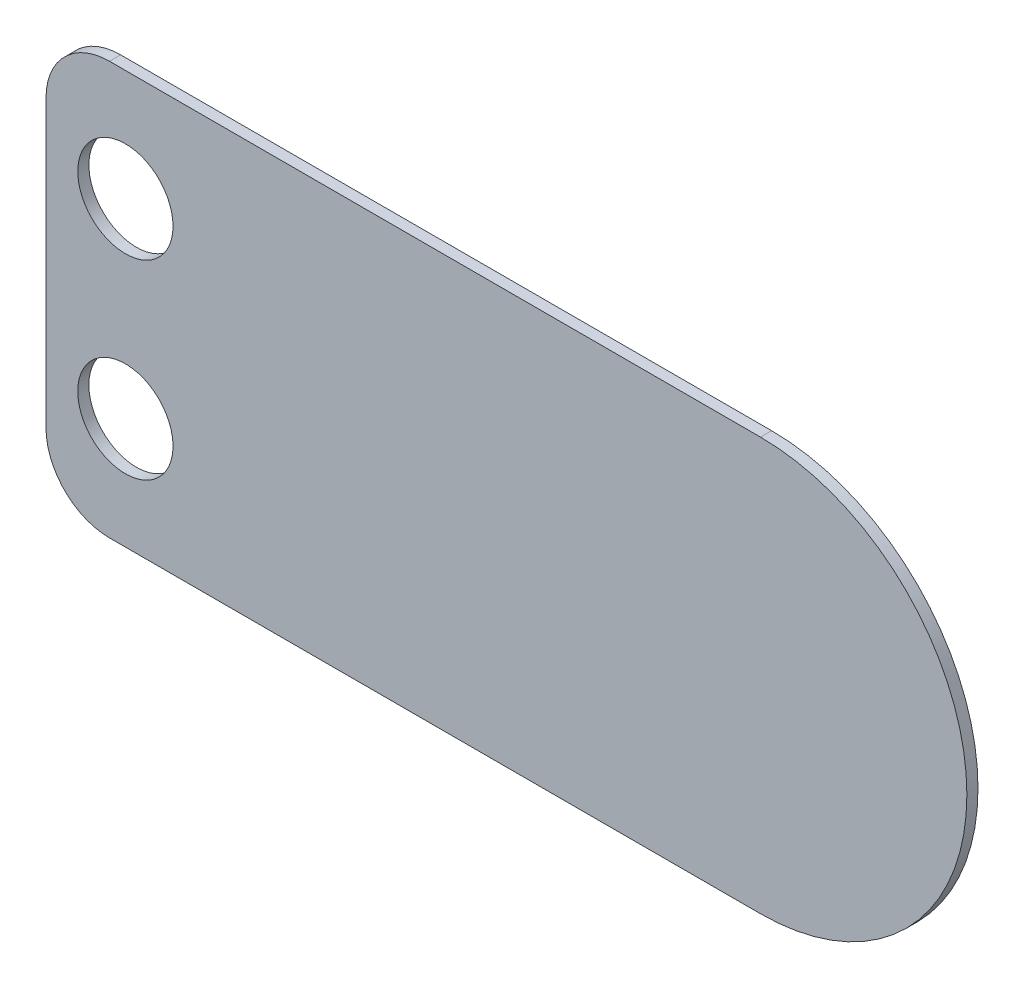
ISO-10303-21;
HEADER;
FILE_DESCRIPTION(('STEP AP214'),'2;1');
FILE_NAME('part.step','',(''),(''),'','','');
FILE_SCHEMA(('AUTOMOTIVE_DESIGN { 1 0 10303 214 1 1 1 1 }'));
ENDSEC;
DATA;
#1=APPLICATION_CONTEXT('core data for automotive mechanical design processes');
#2=APPLICATION_PROTOCOL_DEFINITION('international standard','automotive_design',2000,#1);
#3=PRODUCT_CONTEXT('',#1,'mechanical');
#4=PRODUCT('Part','Part','',(#3));
#5=PRODUCT_RELATED_PRODUCT_CATEGORY('part','',(#4));
#6=PRODUCT_DEFINITION_FORMATION('','',#4);
#7=PRODUCT_DEFINITION_CONTEXT('part definition',#1,'design');
#8=PRODUCT_DEFINITION('design','',#6,#7);
#9=PRODUCT_DEFINITION_SHAPE('','',#8);
#10=(LENGTH_UNIT() NAMED_UNIT(*) SI_UNIT(.MILLI.,.METRE.));
#11=(NAMED_UNIT(*) PLANE_ANGLE_UNIT() SI_UNIT($,.RADIAN.));
#12=(NAMED_UNIT(*) SI_UNIT($,.STERADIAN.) SOLID_ANGLE_UNIT());
#13=UNCERTAINTY_MEASURE_WITH_UNIT(LENGTH_MEASURE(1.E-05),#10,'distance_accuracy_value','');
#14=(GEOMETRIC_REPRESENTATION_CONTEXT(3) GLOBAL_UNCERTAINTY_ASSIGNED_CONTEXT((#13)) GLOBAL_UNIT_ASSIGNED_CONTEXT((#10,
#11,#12)) REPRESENTATION_CONTEXT('',''));
#15=CARTESIAN_POINT('',(0.,0.,0.));
#16=DIRECTION('',(0.,0.,1.));
#17=DIRECTION('',(1.,0.,0.));
#18=AXIS2_PLACEMENT_3D('',#15,#16,#17);
#19=CARTESIAN_POINT('',(0.,0.,0.35));
#20=DIRECTION('',(0.,0.,1.));
#21=DIRECTION('',(1.,0.,0.));
#22=AXIS2_PLACEMENT_3D('',#19,#20,#21);
#23=PLANE('',#22);
#24=CARTESIAN_POINT('',(-20.,3.,0.35));
#25=DIRECTION('',(0.,0.,1.));
#26=DIRECTION('',(1.,0.,0.));
#27=AXIS2_PLACEMENT_3D('',#24,#25,#26);
#28=CIRCLE('',#27,1.5);
#29=CARTESIAN_POINT('',(-18.5,3.,0.35));
#30=VERTEX_POINT('',#29);
#31=EDGE_CURVE('E105',#30,#30,#28,.T.);
#32=ORIENTED_EDGE('',*,*,#31,.F.);
#33=EDGE_LOOP('',(#32));
#34=FACE_BOUND('',#33,.T.);
#35=DIRECTION('',(0.,-1.,0.));
#36=VECTOR('',#35,1.);
#37=CARTESIAN_POINT('',(-22.5,6.5,0.35));
#38=LINE('',#37,#36);
#39=CARTESIAN_POINT('',(-22.5,4.5,0.35));
#40=VERTEX_POINT('',#39);
#41=CARTESIAN_POINT('',(-22.5,-4.5,0.35));
#42=VERTEX_POINT('',#41);
#43=EDGE_CURVE('E118',#40,#42,#38,.T.);
#44=ORIENTED_EDGE('',*,*,#43,.T.);
#45=CARTESIAN_POINT('',(-20.5,-4.5,0.35));
#46=DIRECTION('',(0.,0.,1.));
#47=DIRECTION('',(1.,0.,0.));
#48=AXIS2_PLACEMENT_3D('',#45,#46,#47);
#49=CIRCLE('',#48,2.);
#50=CARTESIAN_POINT('',(-20.5,-6.5,0.35));
#51=VERTEX_POINT('',#50);
#52=EDGE_CURVE('E37',#42,#51,#49,.T.);
#53=ORIENTED_EDGE('',*,*,#52,.T.);
#54=DIRECTION('',(1.,0.,0.));
#55=VECTOR('',#54,1.);
#56=CARTESIAN_POINT('',(0.,-6.5,0.35));
#57=LINE('',#56,#55);
#58=CARTESIAN_POINT('',(0.,-6.5,0.35));
#59=VERTEX_POINT('',#58);
#60=EDGE_CURVE('E120',#51,#59,#57,.T.);
#61=ORIENTED_EDGE('',*,*,#60,.T.);
#62=CARTESIAN_POINT('',(0.,0.,0.35));
#63=DIRECTION('',(0.,0.,1.));
#64=DIRECTION('',(1.,0.,0.));
#65=AXIS2_PLACEMENT_3D('',#62,#63,#64);
#66=CIRCLE('',#65,6.5);
#67=CARTESIAN_POINT('',(0.,6.5,0.35));
#68=VERTEX_POINT('',#67);
#69=EDGE_CURVE('E115',#59,#68,#66,.T.);
#70=ORIENTED_EDGE('',*,*,#69,.T.);
#71=DIRECTION('',(-1.,0.,0.));
#72=VECTOR('',#71,1.);
#73=CARTESIAN_POINT('',(0.,6.5,0.35));
#74=LINE('',#73,#72);
#75=CARTESIAN_POINT('',(-20.5,6.5,0.35));
#76=VERTEX_POINT('',#75);
#77=EDGE_CURVE('E96',#68,#76,#74,.T.);
#78=ORIENTED_EDGE('',*,*,#77,.T.);
#79=CARTESIAN_POINT('',(-20.5,4.5,0.35));
#80=DIRECTION('',(0.,0.,1.));
#81=DIRECTION('',(1.,0.,0.));
#82=AXIS2_PLACEMENT_3D('',#79,#80,#81);
#83=CIRCLE('',#82,2.);
#84=EDGE_CURVE('E132',#76,#40,#83,.T.);
#85=ORIENTED_EDGE('',*,*,#84,.T.);
#86=EDGE_LOOP('',(#44,#53,#61,#70,#78,#85));
#87=FACE_BOUND('',#86,.T.);
#88=CARTESIAN_POINT('',(-20.,-3.,0.35));
#89=DIRECTION('',(0.,0.,1.));
#90=DIRECTION('',(-1.,0.,0.));
#91=AXIS2_PLACEMENT_3D('',#88,#89,#90);
#92=CIRCLE('',#91,1.5);
#93=CARTESIAN_POINT('',(-21.5,-3.,0.35));
#94=VERTEX_POINT('',#93);
#95=EDGE_CURVE('E231',#94,#94,#92,.T.);
#96=ORIENTED_EDGE('',*,*,#95,.F.);
#97=EDGE_LOOP('',(#96));
#98=FACE_BOUND('',#97,.T.);
#99=ADVANCED_FACE('F29',(#34,#87,#98),#23,.T.);
#100=CARTESIAN_POINT('',(0.,0.,0.));
#101=DIRECTION('',(0.,0.,1.));
#102=DIRECTION('',(1.,0.,0.));
#103=AXIS2_PLACEMENT_3D('',#100,#101,#102);
#104=PLANE('',#103);
#105=CARTESIAN_POINT('',(-20.,3.,0.));
#106=DIRECTION('',(0.,0.,1.));
#107=DIRECTION('',(1.,0.,0.));
#108=AXIS2_PLACEMENT_3D('',#105,#106,#107);
#109=CIRCLE('',#108,1.5);
#110=CARTESIAN_POINT('',(-18.5,3.,0.));
#111=VERTEX_POINT('',#110);
#112=EDGE_CURVE('E108',#111,#111,#109,.T.);
#113=ORIENTED_EDGE('',*,*,#112,.T.);
#114=EDGE_LOOP('',(#113));
#115=FACE_BOUND('',#114,.T.);
#116=DIRECTION('',(1.,0.,0.));
#117=VECTOR('',#116,1.);
#118=CARTESIAN_POINT('',(0.,-6.5,0.));
#119=LINE('',#118,#117);
#120=CARTESIAN_POINT('',(-20.5,-6.5,0.));
#121=VERTEX_POINT('',#120);
#122=CARTESIAN_POINT('',(0.,-6.5,0.));
#123=VERTEX_POINT('',#122);
#124=EDGE_CURVE('E113',#121,#123,#119,.T.);
#125=ORIENTED_EDGE('',*,*,#124,.F.);
#126=CARTESIAN_POINT('',(-20.5,-4.5,0.));
#127=DIRECTION('',(0.,0.,1.));
#128=DIRECTION('',(1.,0.,0.));
#129=AXIS2_PLACEMENT_3D('',#126,#127,#128);
#130=CIRCLE('',#129,2.);
#131=CARTESIAN_POINT('',(-22.5,-4.5,0.));
#132=VERTEX_POINT('',#131);
#133=EDGE_CURVE('E126',#121,#132,#130,.F.);
#134=ORIENTED_EDGE('',*,*,#133,.T.);
#135=DIRECTION('',(0.,-1.,0.));
#136=VECTOR('',#135,1.);
#137=CARTESIAN_POINT('',(-22.5,6.5,0.));
#138=LINE('',#137,#136);
#139=CARTESIAN_POINT('',(-22.5,4.5,0.));
#140=VERTEX_POINT('',#139);
#141=EDGE_CURVE('E91',#140,#132,#138,.T.);
#142=ORIENTED_EDGE('',*,*,#141,.F.);
#143=CARTESIAN_POINT('',(-20.5,4.5,0.));
#144=DIRECTION('',(0.,0.,1.));
#145=DIRECTION('',(1.,0.,0.));
#146=AXIS2_PLACEMENT_3D('',#143,#144,#145);
#147=CIRCLE('',#146,2.);
#148=CARTESIAN_POINT('',(-20.5,6.5,0.));
#149=VERTEX_POINT('',#148);
#150=EDGE_CURVE('E90',#140,#149,#147,.F.);
#151=ORIENTED_EDGE('',*,*,#150,.T.);
#152=DIRECTION('',(-1.,0.,0.));
#153=VECTOR('',#152,1.);
#154=CARTESIAN_POINT('',(0.,6.5,0.));
#155=LINE('',#154,#153);
#156=CARTESIAN_POINT('',(0.,6.5,0.));
#157=VERTEX_POINT('',#156);
#158=EDGE_CURVE('E82',#157,#149,#155,.T.);
#159=ORIENTED_EDGE('',*,*,#158,.F.);
#160=CARTESIAN_POINT('',(0.,0.,0.));
#161=DIRECTION('',(0.,0.,1.));
#162=DIRECTION('',(1.,0.,0.));
#163=AXIS2_PLACEMENT_3D('',#160,#161,#162);
#164=CIRCLE('',#163,6.5);
#165=EDGE_CURVE('E88',#123,#157,#164,.T.);
#166=ORIENTED_EDGE('',*,*,#165,.F.);
#167=EDGE_LOOP('',(#125,#134,#142,#151,#159,#166));
#168=FACE_BOUND('',#167,.T.);
#169=CARTESIAN_POINT('',(-20.,-3.,0.));
#170=DIRECTION('',(0.,0.,1.));
#171=DIRECTION('',(-1.,0.,0.));
#172=AXIS2_PLACEMENT_3D('',#169,#170,#171);
#173=CIRCLE('',#172,1.5);
#174=CARTESIAN_POINT('',(-21.5,-3.,0.));
#175=VERTEX_POINT('',#174);
#176=EDGE_CURVE('E233',#175,#175,#173,.T.);
#177=ORIENTED_EDGE('',*,*,#176,.T.);
#178=EDGE_LOOP('',(#177));
#179=FACE_BOUND('',#178,.T.);
#180=ADVANCED_FACE('F85',(#115,#168,#179),#104,.F.);
#181=CARTESIAN_POINT('',(0.,0.,0.35));
#182=DIRECTION('',(0.,0.,-1.));
#183=DIRECTION('',(-1.,0.,0.));
#184=AXIS2_PLACEMENT_3D('',#181,#182,#183);
#185=CYLINDRICAL_SURFACE('',#184,6.5);
#186=ORIENTED_EDGE('',*,*,#165,.T.);
#187=DIRECTION('',(0.,0.,-1.));
#188=VECTOR('',#187,1.);
#189=CARTESIAN_POINT('',(0.,6.5,0.35));
#190=LINE('',#189,#188);
#191=EDGE_CURVE('E94',#68,#157,#190,.T.);
#192=ORIENTED_EDGE('',*,*,#191,.F.);
#193=ORIENTED_EDGE('',*,*,#69,.F.);
#194=DIRECTION('',(0.,0.,-1.));
#195=VECTOR('',#194,1.);
#196=CARTESIAN_POINT('',(0.,-6.5,0.35));
#197=LINE('',#196,#195);
#198=EDGE_CURVE('E101',#59,#123,#197,.T.);
#199=ORIENTED_EDGE('',*,*,#198,.T.);
#200=EDGE_LOOP('',(#186,#192,#193,#199));
#201=FACE_BOUND('',#200,.T.);
#202=ADVANCED_FACE('F31',(#201),#185,.T.);
#203=CARTESIAN_POINT('',(0.,6.5,0.35));
#204=DIRECTION('',(0.,-1.,0.));
#205=DIRECTION('',(1.,0.,0.));
#206=AXIS2_PLACEMENT_3D('',#203,#204,#205);
#207=PLANE('',#206);
#208=ORIENTED_EDGE('',*,*,#158,.T.);
#209=DIRECTION('',(0.,0.,-1.));
#210=VECTOR('',#209,1.);
#211=CARTESIAN_POINT('',(-20.5,6.5,0.35));
#212=LINE('',#211,#210);
#213=EDGE_CURVE('E11',#149,#76,#212,.F.);
#214=ORIENTED_EDGE('',*,*,#213,.T.);
#215=ORIENTED_EDGE('',*,*,#77,.F.);
#216=ORIENTED_EDGE('',*,*,#191,.T.);
#217=EDGE_LOOP('',(#208,#214,#215,#216));
#218=FACE_BOUND('',#217,.T.);
#219=ADVANCED_FACE('F95',(#218),#207,.F.);
#220=CARTESIAN_POINT('',(-22.5,6.5,0.35));
#221=DIRECTION('',(1.,0.,0.));
#222=DIRECTION('',(0.,0.,-1.));
#223=AXIS2_PLACEMENT_3D('',#220,#221,#222);
#224=PLANE('',#223);
#225=ORIENTED_EDGE('',*,*,#141,.T.);
#226=DIRECTION('',(0.,0.,-1.));
#227=VECTOR('',#226,1.);
#228=CARTESIAN_POINT('',(-22.5,-4.5,0.35));
#229=LINE('',#228,#227);
#230=EDGE_CURVE('E50',#132,#42,#229,.F.);
#231=ORIENTED_EDGE('',*,*,#230,.T.);
#232=ORIENTED_EDGE('',*,*,#43,.F.);
#233=DIRECTION('',(0.,0.,-1.));
#234=VECTOR('',#233,1.);
#235=CARTESIAN_POINT('',(-22.5,4.5,0.35));
#236=LINE('',#235,#234);
#237=EDGE_CURVE('E128',#40,#140,#236,.T.);
#238=ORIENTED_EDGE('',*,*,#237,.T.);
#239=EDGE_LOOP('',(#225,#231,#232,#238));
#240=FACE_BOUND('',#239,.T.);
#241=ADVANCED_FACE('F142',(#240),#224,.F.);
#242=CARTESIAN_POINT('',(0.,-6.5,0.35));
#243=DIRECTION('',(0.,1.,0.));
#244=DIRECTION('',(-1.,0.,0.));
#245=AXIS2_PLACEMENT_3D('',#242,#243,#244);
#246=PLANE('',#245);
#247=ORIENTED_EDGE('',*,*,#60,.F.);
#248=DIRECTION('',(0.,0.,-1.));
#249=VECTOR('',#248,1.);
#250=CARTESIAN_POINT('',(-20.5,-6.5,0.35));
#251=LINE('',#250,#249);
#252=EDGE_CURVE('E100',#51,#121,#251,.T.);
#253=ORIENTED_EDGE('',*,*,#252,.T.);
#254=ORIENTED_EDGE('',*,*,#124,.T.);
#255=ORIENTED_EDGE('',*,*,#198,.F.);
#256=EDGE_LOOP('',(#247,#253,#254,#255));
#257=FACE_BOUND('',#256,.T.);
#258=ADVANCED_FACE('F140',(#257),#246,.F.);
#259=CARTESIAN_POINT('',(-20.,3.,0.35));
#260=DIRECTION('',(0.,0.,-1.));
#261=DIRECTION('',(-1.,0.,0.));
#262=AXIS2_PLACEMENT_3D('',#259,#260,#261);
#263=CYLINDRICAL_SURFACE('',#262,1.5);
#264=ORIENTED_EDGE('',*,*,#31,.T.);
#265=EDGE_LOOP('',(#264));
#266=FACE_BOUND('',#265,.T.);
#267=ORIENTED_EDGE('',*,*,#112,.F.);
#268=EDGE_LOOP('',(#267));
#269=FACE_BOUND('',#268,.T.);
#270=ADVANCED_FACE('F167',(#266,#269),#263,.F.);
#271=CARTESIAN_POINT('',(-20.,-3.,0.35));
#272=DIRECTION('',(0.,0.,-1.));
#273=DIRECTION('',(-1.,0.,0.));
#274=AXIS2_PLACEMENT_3D('',#271,#272,#273);
#275=CYLINDRICAL_SURFACE('',#274,1.5);
#276=ORIENTED_EDGE('',*,*,#95,.T.);
#277=EDGE_LOOP('',(#276));
#278=FACE_BOUND('',#277,.T.);
#279=ORIENTED_EDGE('',*,*,#176,.F.);
#280=EDGE_LOOP('',(#279));
#281=FACE_BOUND('',#280,.T.);
#282=ADVANCED_FACE('F152',(#278,#281),#275,.F.);
#283=CARTESIAN_POINT('',(-20.5,-4.5,0.35));
#284=DIRECTION('',(0.,0.,-1.));
#285=DIRECTION('',(-1.,0.,0.));
#286=AXIS2_PLACEMENT_3D('',#283,#284,#285);
#287=CYLINDRICAL_SURFACE('',#286,2.);
#288=ORIENTED_EDGE('',*,*,#52,.F.);
#289=ORIENTED_EDGE('',*,*,#230,.F.);
#290=ORIENTED_EDGE('',*,*,#133,.F.);
#291=ORIENTED_EDGE('',*,*,#252,.F.);
#292=EDGE_LOOP('',(#288,#289,#290,#291));
#293=FACE_BOUND('',#292,.T.);
#294=ADVANCED_FACE('F141',(#293),#287,.T.);
#295=CARTESIAN_POINT('',(-20.5,4.5,0.35));
#296=DIRECTION('',(0.,0.,-1.));
#297=DIRECTION('',(-1.,0.,0.));
#298=AXIS2_PLACEMENT_3D('',#295,#296,#297);
#299=CYLINDRICAL_SURFACE('',#298,2.);
#300=ORIENTED_EDGE('',*,*,#84,.F.);
#301=ORIENTED_EDGE('',*,*,#213,.F.);
#302=ORIENTED_EDGE('',*,*,#150,.F.);
#303=ORIENTED_EDGE('',*,*,#237,.F.);
#304=EDGE_LOOP('',(#300,#301,#302,#303));
#305=FACE_BOUND('',#304,.T.);
#306=ADVANCED_FACE('F146',(#305),#299,.T.);
#307=CLOSED_SHELL('',(#99,#180,#202,#219,#241,#258,#270,#282,#294,#306));
#308=MANIFOLD_SOLID_BREP('B2',#307);
#309=ADVANCED_BREP_SHAPE_REPRESENTATION('',(#18,#308),#14);
#310=SHAPE_DEFINITION_REPRESENTATION(#9,#309);
ENDSEC;
END-ISO-10303-21;
